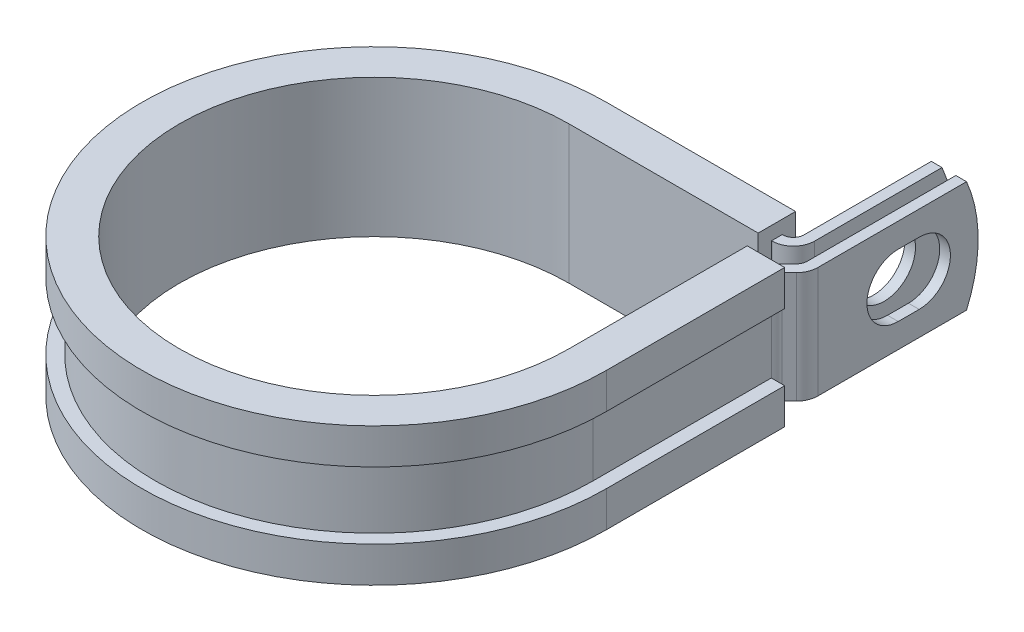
ISO-10303-21;
HEADER;
FILE_DESCRIPTION(('STEP AP214'),'2;1');
FILE_NAME('part.step','',(''),(''),'','','');
FILE_SCHEMA(('AUTOMOTIVE_DESIGN { 1 0 10303 214 1 1 1 1 }'));
ENDSEC;
DATA;
#1=APPLICATION_CONTEXT('core data for automotive mechanical design processes');
#2=APPLICATION_PROTOCOL_DEFINITION('international standard','automotive_design',2000,#1);
#3=PRODUCT_CONTEXT('',#1,'mechanical');
#4=PRODUCT('Part','Part','',(#3));
#5=PRODUCT_RELATED_PRODUCT_CATEGORY('part','',(#4));
#6=PRODUCT_DEFINITION_FORMATION('','',#4);
#7=PRODUCT_DEFINITION_CONTEXT('part definition',#1,'design');
#8=PRODUCT_DEFINITION('design','',#6,#7);
#9=PRODUCT_DEFINITION_SHAPE('','',#8);
#10=(LENGTH_UNIT() NAMED_UNIT(*) SI_UNIT(.MILLI.,.METRE.));
#11=(NAMED_UNIT(*) PLANE_ANGLE_UNIT() SI_UNIT($,.RADIAN.));
#12=(NAMED_UNIT(*) SI_UNIT($,.STERADIAN.) SOLID_ANGLE_UNIT());
#13=UNCERTAINTY_MEASURE_WITH_UNIT(LENGTH_MEASURE(1.E-05),#10,'distance_accuracy_value','');
#14=(GEOMETRIC_REPRESENTATION_CONTEXT(3) GLOBAL_UNCERTAINTY_ASSIGNED_CONTEXT((#13)) GLOBAL_UNIT_ASSIGNED_CONTEXT((#10,
#11,#12)) REPRESENTATION_CONTEXT('',''));
#15=CARTESIAN_POINT('',(0.,0.,0.));
#16=DIRECTION('',(0.,0.,1.));
#17=DIRECTION('',(1.,0.,0.));
#18=AXIS2_PLACEMENT_3D('',#15,#16,#17);
#19=CARTESIAN_POINT('',(24.4272698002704,-6.35,-23.749));
#20=DIRECTION('',(0.,1.,0.));
#21=DIRECTION('',(1.,0.,0.));
#22=AXIS2_PLACEMENT_3D('',#19,#20,#21);
#23=PLANE('',#22);
#24=DIRECTION('',(0.,0.,-1.));
#25=VECTOR('',#24,1.);
#26=CARTESIAN_POINT('',(21.5824698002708,-6.35,-23.749));
#27=LINE('',#26,#25);
#28=CARTESIAN_POINT('',(21.5824698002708,-6.35,-23.749));
#29=VERTEX_POINT('',#28);
#30=CARTESIAN_POINT('',(21.5824698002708,-6.35,-24.9682));
#31=VERTEX_POINT('',#30);
#32=EDGE_CURVE('E523',#29,#31,#27,.T.);
#33=ORIENTED_EDGE('',*,*,#32,.T.);
#34=DIRECTION('',(1.,0.,0.));
#35=VECTOR('',#34,1.);
#36=CARTESIAN_POINT('',(0.,-6.35,-24.9682));
#37=LINE('',#36,#35);
#38=CARTESIAN_POINT('',(21.6332698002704,-6.35,-24.9682));
#39=VERTEX_POINT('',#38);
#40=EDGE_CURVE('E410',#39,#31,#37,.F.);
#41=ORIENTED_EDGE('',*,*,#40,.F.);
#42=CARTESIAN_POINT('',(21.6332698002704,-6.35,-26.1874));
#43=DIRECTION('',(0.,1.,0.));
#44=DIRECTION('',(1.,0.,0.));
#45=AXIS2_PLACEMENT_3D('',#42,#43,#44);
#46=CIRCLE('',#45,1.2192);
#47=CARTESIAN_POINT('',(22.8524698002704,-6.35,-26.1874));
#48=VERTEX_POINT('',#47);
#49=EDGE_CURVE('E408',#48,#39,#46,.F.);
#50=ORIENTED_EDGE('',*,*,#49,.F.);
#51=DIRECTION('',(0.,0.,1.));
#52=VECTOR('',#51,1.);
#53=CARTESIAN_POINT('',(22.8524698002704,-6.35,-42.037));
#54=LINE('',#53,#52);
#55=CARTESIAN_POINT('',(22.8524698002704,-6.35,-40.7116778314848));
#56=VERTEX_POINT('',#55);
#57=EDGE_CURVE('E406',#56,#48,#54,.T.);
#58=ORIENTED_EDGE('',*,*,#57,.F.);
#59=DIRECTION('',(-1.,0.,0.));
#60=VECTOR('',#59,1.);
#61=CARTESIAN_POINT('',(26.8656698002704,-6.35,-40.7116778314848));
#62=LINE('',#61,#60);
#63=CARTESIAN_POINT('',(24.0716698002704,-6.35,-40.7116778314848));
#64=VERTEX_POINT('',#63);
#65=EDGE_CURVE('E12',#64,#56,#62,.T.);
#66=ORIENTED_EDGE('',*,*,#65,.F.);
#67=DIRECTION('',(0.,0.,1.));
#68=VECTOR('',#67,1.);
#69=CARTESIAN_POINT('',(24.0716698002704,-6.35,-42.037));
#70=LINE('',#69,#68);
#71=CARTESIAN_POINT('',(24.0716698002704,-6.35,-26.1874));
#72=VERTEX_POINT('',#71);
#73=EDGE_CURVE('E404',#64,#72,#70,.T.);
#74=ORIENTED_EDGE('',*,*,#73,.T.);
#75=CARTESIAN_POINT('',(21.6332698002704,-6.35,-26.1874));
#76=DIRECTION('',(0.,-1.,0.));
#77=DIRECTION('',(0.,0.,1.));
#78=AXIS2_PLACEMENT_3D('',#75,#76,#77);
#79=CIRCLE('',#78,2.4384);
#80=CARTESIAN_POINT('',(21.6332698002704,-6.35,-23.749));
#81=VERTEX_POINT('',#80);
#82=EDGE_CURVE('E401',#72,#81,#79,.T.);
#83=ORIENTED_EDGE('',*,*,#82,.T.);
#84=DIRECTION('',(-1.,0.,0.));
#85=VECTOR('',#84,1.);
#86=CARTESIAN_POINT('',(0.,-6.35,-23.749));
#87=LINE('',#86,#85);
#88=EDGE_CURVE('E398',#81,#29,#87,.T.);
#89=ORIENTED_EDGE('',*,*,#88,.T.);
#90=EDGE_LOOP('',(#33,#41,#50,#58,#66,#74,#83,#89));
#91=FACE_BOUND('',#90,.T.);
#92=ADVANCED_FACE('F54',(#91),#23,.F.);
#93=CARTESIAN_POINT('',(24.4272698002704,6.35,-23.749));
#94=DIRECTION('',(0.,1.,0.));
#95=DIRECTION('',(1.,0.,0.));
#96=AXIS2_PLACEMENT_3D('',#93,#94,#95);
#97=PLANE('',#96);
#98=DIRECTION('',(1.,0.,0.));
#99=VECTOR('',#98,1.);
#100=CARTESIAN_POINT('',(0.,6.35,-24.9682));
#101=LINE('',#100,#99);
#102=CARTESIAN_POINT('',(21.6332698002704,6.35,-24.9682));
#103=VERTEX_POINT('',#102);
#104=CARTESIAN_POINT('',(21.5824698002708,6.35,-24.9682));
#105=VERTEX_POINT('',#104);
#106=EDGE_CURVE('E368',#103,#105,#101,.F.);
#107=ORIENTED_EDGE('',*,*,#106,.T.);
#108=DIRECTION('',(0.,0.,1.));
#109=VECTOR('',#108,1.);
#110=CARTESIAN_POINT('',(21.5824698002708,6.35,-24.9682));
#111=LINE('',#110,#109);
#112=CARTESIAN_POINT('',(21.5824698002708,6.35,-23.749));
#113=VERTEX_POINT('',#112);
#114=EDGE_CURVE('E517',#105,#113,#111,.T.);
#115=ORIENTED_EDGE('',*,*,#114,.T.);
#116=DIRECTION('',(-1.,0.,0.));
#117=VECTOR('',#116,1.);
#118=CARTESIAN_POINT('',(0.,6.35,-23.749));
#119=LINE('',#118,#117);
#120=CARTESIAN_POINT('',(21.6332698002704,6.35,-23.749));
#121=VERTEX_POINT('',#120);
#122=EDGE_CURVE('E625',#121,#113,#119,.T.);
#123=ORIENTED_EDGE('',*,*,#122,.F.);
#124=CARTESIAN_POINT('',(21.6332698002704,6.35,-26.1874));
#125=DIRECTION('',(0.,-1.,0.));
#126=DIRECTION('',(0.,0.,1.));
#127=AXIS2_PLACEMENT_3D('',#124,#125,#126);
#128=CIRCLE('',#127,2.4384);
#129=CARTESIAN_POINT('',(24.0716698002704,6.35,-26.1874));
#130=VERTEX_POINT('',#129);
#131=EDGE_CURVE('E370',#130,#121,#128,.T.);
#132=ORIENTED_EDGE('',*,*,#131,.F.);
#133=DIRECTION('',(0.,0.,1.));
#134=VECTOR('',#133,1.);
#135=CARTESIAN_POINT('',(24.0716698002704,6.35,-42.037));
#136=LINE('',#135,#134);
#137=CARTESIAN_POINT('',(24.0716698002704,6.35,-40.7116778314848));
#138=VERTEX_POINT('',#137);
#139=EDGE_CURVE('E361',#138,#130,#136,.T.);
#140=ORIENTED_EDGE('',*,*,#139,.F.);
#141=DIRECTION('',(-1.,0.,0.));
#142=VECTOR('',#141,1.);
#143=CARTESIAN_POINT('',(26.8656698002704,6.35,-40.7116778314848));
#144=LINE('',#143,#142);
#145=CARTESIAN_POINT('',(22.8524698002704,6.35,-40.7116778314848));
#146=VERTEX_POINT('',#145);
#147=EDGE_CURVE('E62',#138,#146,#144,.T.);
#148=ORIENTED_EDGE('',*,*,#147,.T.);
#149=DIRECTION('',(0.,0.,1.));
#150=VECTOR('',#149,1.);
#151=CARTESIAN_POINT('',(22.8524698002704,6.35,-42.037));
#152=LINE('',#151,#150);
#153=CARTESIAN_POINT('',(22.8524698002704,6.35,-26.1874));
#154=VERTEX_POINT('',#153);
#155=EDGE_CURVE('E358',#146,#154,#152,.T.);
#156=ORIENTED_EDGE('',*,*,#155,.T.);
#157=CARTESIAN_POINT('',(21.6332698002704,6.35,-26.1874));
#158=DIRECTION('',(0.,1.,0.));
#159=DIRECTION('',(1.,0.,0.));
#160=AXIS2_PLACEMENT_3D('',#157,#158,#159);
#161=CIRCLE('',#160,1.2192);
#162=EDGE_CURVE('E366',#154,#103,#161,.F.);
#163=ORIENTED_EDGE('',*,*,#162,.T.);
#164=EDGE_LOOP('',(#107,#115,#123,#132,#140,#148,#156,#163));
#165=FACE_BOUND('',#164,.T.);
#166=ADVANCED_FACE('F357',(#165),#97,.T.);
#167=CARTESIAN_POINT('',(0.,6.35,-23.749));
#168=DIRECTION('',(0.,0.,1.));
#169=DIRECTION('',(1.,0.,0.));
#170=AXIS2_PLACEMENT_3D('',#167,#168,#169);
#171=PLANE('',#170);
#172=ORIENTED_EDGE('',*,*,#122,.T.);
#173=DIRECTION('',(0.,-1.,0.));
#174=VECTOR('',#173,1.);
#175=CARTESIAN_POINT('',(21.5824698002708,6.35,-23.749));
#176=LINE('',#175,#174);
#177=EDGE_CURVE('E520',#113,#29,#176,.T.);
#178=ORIENTED_EDGE('',*,*,#177,.T.);
#179=ORIENTED_EDGE('',*,*,#88,.F.);
#180=DIRECTION('',(0.,-1.,0.));
#181=VECTOR('',#180,1.);
#182=CARTESIAN_POINT('',(21.6332698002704,6.35,-23.749));
#183=LINE('',#182,#181);
#184=EDGE_CURVE('E344',#121,#81,#183,.T.);
#185=ORIENTED_EDGE('',*,*,#184,.F.);
#186=EDGE_LOOP('',(#172,#178,#179,#185));
#187=FACE_BOUND('',#186,.T.);
#188=ADVANCED_FACE('F635',(#187),#171,.T.);
#189=CARTESIAN_POINT('',(26.8656698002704,6.35,-23.749));
#190=DIRECTION('',(-1.,0.,0.));
#191=DIRECTION('',(0.,0.,1.));
#192=AXIS2_PLACEMENT_3D('',#189,#190,#191);
#193=PLANE('',#192);
#194=CARTESIAN_POINT('',(26.8656698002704,0.,-35.3059999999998));
#195=DIRECTION('',(1.,0.,0.));
#196=DIRECTION('',(0.,0.,-1.));
#197=AXIS2_PLACEMENT_3D('',#194,#195,#196);
#198=CIRCLE('',#197,3.5687);
#199=CARTESIAN_POINT('',(26.8656698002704,-3.5687,-35.3060000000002));
#200=VERTEX_POINT('',#199);
#201=CARTESIAN_POINT('',(26.8656698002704,3.5687,-35.3060000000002));
#202=VERTEX_POINT('',#201);
#203=EDGE_CURVE('E580',#200,#202,#198,.T.);
#204=ORIENTED_EDGE('',*,*,#203,.F.);
#205=DIRECTION('',(0.,0.,-1.));
#206=VECTOR('',#205,1.);
#207=CARTESIAN_POINT('',(26.8656698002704,-3.5687,-32.9183999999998));
#208=LINE('',#207,#206);
#209=CARTESIAN_POINT('',(26.8656698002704,-3.5687,-32.9183999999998));
#210=VERTEX_POINT('',#209);
#211=EDGE_CURVE('E583',#210,#200,#208,.T.);
#212=ORIENTED_EDGE('',*,*,#211,.F.);
#213=CARTESIAN_POINT('',(26.8656698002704,0.,-32.9183999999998));
#214=DIRECTION('',(1.,0.,0.));
#215=DIRECTION('',(0.,0.,-1.));
#216=AXIS2_PLACEMENT_3D('',#213,#214,#215);
#217=CIRCLE('',#216,3.5687);
#218=CARTESIAN_POINT('',(26.8656698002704,3.5687,-32.9183999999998));
#219=VERTEX_POINT('',#218);
#220=EDGE_CURVE('E576',#219,#210,#217,.T.);
#221=ORIENTED_EDGE('',*,*,#220,.F.);
#222=DIRECTION('',(0.,0.,1.));
#223=VECTOR('',#222,1.);
#224=CARTESIAN_POINT('',(26.8656698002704,3.5687,-32.9183999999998));
#225=LINE('',#224,#223);
#226=EDGE_CURVE('E577',#202,#219,#225,.T.);
#227=ORIENTED_EDGE('',*,*,#226,.F.);
#228=EDGE_LOOP('',(#204,#212,#221,#227));
#229=FACE_BOUND('',#228,.T.);
#230=DIRECTION('',(0.,0.,-1.));
#231=VECTOR('',#230,1.);
#232=CARTESIAN_POINT('',(26.8656698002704,-6.35,-23.749));
#233=LINE('',#232,#231);
#234=CARTESIAN_POINT('',(26.8656698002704,-6.35,-23.749));
#235=VERTEX_POINT('',#234);
#236=CARTESIAN_POINT('',(26.8656698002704,-6.35,-40.7116778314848));
#237=VERTEX_POINT('',#236);
#238=EDGE_CURVE('E382',#235,#237,#233,.T.);
#239=ORIENTED_EDGE('',*,*,#238,.T.);
#240=CARTESIAN_POINT('',(26.8656698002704,0.,-26.162));
#241=DIRECTION('',(-1.,0.,0.));
#242=DIRECTION('',(0.,0.,1.));
#243=AXIS2_PLACEMENT_3D('',#240,#241,#242);
#244=CIRCLE('',#243,15.875);
#245=CARTESIAN_POINT('',(26.8656698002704,6.35,-40.7116778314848));
#246=VERTEX_POINT('',#245);
#247=EDGE_CURVE('E568',#246,#237,#244,.T.);
#248=ORIENTED_EDGE('',*,*,#247,.F.);
#249=DIRECTION('',(0.,0.,-1.));
#250=VECTOR('',#249,1.);
#251=CARTESIAN_POINT('',(26.8656698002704,6.35,-23.749));
#252=LINE('',#251,#250);
#253=CARTESIAN_POINT('',(26.8656698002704,6.35,-23.749));
#254=VERTEX_POINT('',#253);
#255=EDGE_CURVE('E419',#254,#246,#252,.T.);
#256=ORIENTED_EDGE('',*,*,#255,.F.);
#257=DIRECTION('',(0.,-1.,0.));
#258=VECTOR('',#257,1.);
#259=CARTESIAN_POINT('',(26.8656698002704,6.35,-23.749));
#260=LINE('',#259,#258);
#261=EDGE_CURVE('E381',#254,#235,#260,.T.);
#262=ORIENTED_EDGE('',*,*,#261,.T.);
#263=EDGE_LOOP('',(#239,#248,#256,#262));
#264=FACE_BOUND('',#263,.T.);
#265=ADVANCED_FACE('F56',(#229,#264),#193,.F.);
#266=CARTESIAN_POINT('',(25.6464698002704,6.35,-23.749));
#267=DIRECTION('',(-1.,0.,0.));
#268=DIRECTION('',(0.,0.,1.));
#269=AXIS2_PLACEMENT_3D('',#266,#267,#268);
#270=PLANE('',#269);
#271=DIRECTION('',(0.,0.,-1.));
#272=VECTOR('',#271,1.);
#273=CARTESIAN_POINT('',(25.6464698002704,-3.5687,-32.9183999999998));
#274=LINE('',#273,#272);
#275=CARTESIAN_POINT('',(25.6464698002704,-3.5687,-32.9183999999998));
#276=VERTEX_POINT('',#275);
#277=CARTESIAN_POINT('',(25.6464698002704,-3.5687,-35.3060000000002));
#278=VERTEX_POINT('',#277);
#279=EDGE_CURVE('E579',#276,#278,#274,.T.);
#280=ORIENTED_EDGE('',*,*,#279,.T.);
#281=CARTESIAN_POINT('',(25.6464698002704,0.,-35.3059999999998));
#282=DIRECTION('',(-1.,0.,0.));
#283=DIRECTION('',(0.,0.,1.));
#284=AXIS2_PLACEMENT_3D('',#281,#282,#283);
#285=CIRCLE('',#284,3.5687);
#286=CARTESIAN_POINT('',(25.6464698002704,3.5687,-35.3060000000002));
#287=VERTEX_POINT('',#286);
#288=EDGE_CURVE('E600',#278,#287,#285,.F.);
#289=ORIENTED_EDGE('',*,*,#288,.T.);
#290=DIRECTION('',(0.,0.,1.));
#291=VECTOR('',#290,1.);
#292=CARTESIAN_POINT('',(25.6464698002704,3.5687,-32.9183999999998));
#293=LINE('',#292,#291);
#294=CARTESIAN_POINT('',(25.6464698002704,3.5687,-32.9183999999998));
#295=VERTEX_POINT('',#294);
#296=EDGE_CURVE('E596',#287,#295,#293,.T.);
#297=ORIENTED_EDGE('',*,*,#296,.T.);
#298=CARTESIAN_POINT('',(25.6464698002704,0.,-32.9183999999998));
#299=DIRECTION('',(-1.,0.,0.));
#300=DIRECTION('',(0.,0.,1.));
#301=AXIS2_PLACEMENT_3D('',#298,#299,#300);
#302=CIRCLE('',#301,3.5687);
#303=EDGE_CURVE('E591',#295,#276,#302,.F.);
#304=ORIENTED_EDGE('',*,*,#303,.T.);
#305=EDGE_LOOP('',(#280,#289,#297,#304));
#306=FACE_BOUND('',#305,.T.);
#307=CARTESIAN_POINT('',(25.6464698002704,0.,-26.162));
#308=DIRECTION('',(-1.,0.,0.));
#309=DIRECTION('',(0.,0.,1.));
#310=AXIS2_PLACEMENT_3D('',#307,#308,#309);
#311=CIRCLE('',#310,15.875);
#312=CARTESIAN_POINT('',(25.6464698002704,6.35,-40.7116778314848));
#313=VERTEX_POINT('',#312);
#314=CARTESIAN_POINT('',(25.6464698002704,-6.35,-40.7116778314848));
#315=VERTEX_POINT('',#314);
#316=EDGE_CURVE('E76',#313,#315,#311,.T.);
#317=ORIENTED_EDGE('',*,*,#316,.T.);
#318=DIRECTION('',(0.,0.,-1.));
#319=VECTOR('',#318,1.);
#320=CARTESIAN_POINT('',(25.6464698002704,-6.35,-23.749));
#321=LINE('',#320,#319);
#322=CARTESIAN_POINT('',(25.6464698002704,-6.35,-23.749));
#323=VERTEX_POINT('',#322);
#324=EDGE_CURVE('E385',#323,#315,#321,.T.);
#325=ORIENTED_EDGE('',*,*,#324,.F.);
#326=DIRECTION('',(0.,-1.,0.));
#327=VECTOR('',#326,1.);
#328=CARTESIAN_POINT('',(25.6464698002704,6.35,-23.749));
#329=LINE('',#328,#327);
#330=CARTESIAN_POINT('',(25.6464698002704,6.35,-23.749));
#331=VERTEX_POINT('',#330);
#332=EDGE_CURVE('E352',#331,#323,#329,.T.);
#333=ORIENTED_EDGE('',*,*,#332,.F.);
#334=DIRECTION('',(0.,0.,-1.));
#335=VECTOR('',#334,1.);
#336=CARTESIAN_POINT('',(25.6464698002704,6.35,-23.749));
#337=LINE('',#336,#335);
#338=EDGE_CURVE('E615',#331,#313,#337,.T.);
#339=ORIENTED_EDGE('',*,*,#338,.T.);
#340=EDGE_LOOP('',(#317,#325,#333,#339));
#341=FACE_BOUND('',#340,.T.);
#342=ADVANCED_FACE('F689',(#306,#341),#270,.T.);
#343=CARTESIAN_POINT('',(24.0716698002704,6.35,-42.037));
#344=DIRECTION('',(1.,0.,0.));
#345=DIRECTION('',(0.,0.,-1.));
#346=AXIS2_PLACEMENT_3D('',#343,#344,#345);
#347=PLANE('',#346);
#348=CARTESIAN_POINT('',(24.0716698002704,0.,-34.1122));
#349=DIRECTION('',(1.,0.,0.));
#350=DIRECTION('',(0.,0.,-1.));
#351=AXIS2_PLACEMENT_3D('',#348,#349,#350);
#352=CIRCLE('',#351,3.5687);
#353=CARTESIAN_POINT('',(24.0716698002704,0.,-37.6809));
#354=VERTEX_POINT('',#353);
#355=EDGE_CURVE('E386',#354,#354,#352,.F.);
#356=ORIENTED_EDGE('',*,*,#355,.T.);
#357=EDGE_LOOP('',(#356));
#358=FACE_BOUND('',#357,.T.);
#359=ORIENTED_EDGE('',*,*,#73,.F.);
#360=CARTESIAN_POINT('',(24.0716698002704,0.,-26.162));
#361=DIRECTION('',(1.,0.,0.));
#362=DIRECTION('',(0.,0.,-1.));
#363=AXIS2_PLACEMENT_3D('',#360,#361,#362);
#364=CIRCLE('',#363,15.875);
#365=EDGE_CURVE('E573',#64,#138,#364,.T.);
#366=ORIENTED_EDGE('',*,*,#365,.T.);
#367=ORIENTED_EDGE('',*,*,#139,.T.);
#368=DIRECTION('',(0.,-1.,0.));
#369=VECTOR('',#368,1.);
#370=CARTESIAN_POINT('',(24.0716698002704,6.35,-26.1874));
#371=LINE('',#370,#369);
#372=EDGE_CURVE('E341',#130,#72,#371,.T.);
#373=ORIENTED_EDGE('',*,*,#372,.T.);
#374=EDGE_LOOP('',(#359,#366,#367,#373));
#375=FACE_BOUND('',#374,.T.);
#376=ADVANCED_FACE('F641',(#358,#375),#347,.T.);
#377=CARTESIAN_POINT('',(22.8524698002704,6.35,-42.037));
#378=DIRECTION('',(1.,0.,0.));
#379=DIRECTION('',(0.,0.,-1.));
#380=AXIS2_PLACEMENT_3D('',#377,#378,#379);
#381=PLANE('',#380);
#382=CARTESIAN_POINT('',(22.8524698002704,0.,-34.1122));
#383=DIRECTION('',(-1.,0.,0.));
#384=DIRECTION('',(0.,0.,1.));
#385=AXIS2_PLACEMENT_3D('',#382,#383,#384);
#386=CIRCLE('',#385,3.5687);
#387=CARTESIAN_POINT('',(22.8524698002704,0.,-30.5435));
#388=VERTEX_POINT('',#387);
#389=EDGE_CURVE('E608',#388,#388,#386,.T.);
#390=ORIENTED_EDGE('',*,*,#389,.F.);
#391=EDGE_LOOP('',(#390));
#392=FACE_BOUND('',#391,.T.);
#393=CARTESIAN_POINT('',(22.8524698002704,0.,-26.162));
#394=DIRECTION('',(-1.,0.,0.));
#395=DIRECTION('',(0.,0.,1.));
#396=AXIS2_PLACEMENT_3D('',#393,#394,#395);
#397=CIRCLE('',#396,15.875);
#398=EDGE_CURVE('E68',#146,#56,#397,.T.);
#399=ORIENTED_EDGE('',*,*,#398,.T.);
#400=ORIENTED_EDGE('',*,*,#57,.T.);
#401=DIRECTION('',(0.,-1.,0.));
#402=VECTOR('',#401,1.);
#403=CARTESIAN_POINT('',(22.8524698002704,6.35,-26.1874));
#404=LINE('',#403,#402);
#405=EDGE_CURVE('E338',#154,#48,#404,.T.);
#406=ORIENTED_EDGE('',*,*,#405,.F.);
#407=ORIENTED_EDGE('',*,*,#155,.F.);
#408=EDGE_LOOP('',(#399,#400,#406,#407));
#409=FACE_BOUND('',#408,.T.);
#410=ADVANCED_FACE('F364',(#392,#409),#381,.F.);
#411=CARTESIAN_POINT('',(26.1874,-6.35,-20.3365026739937));
#412=DIRECTION('',(0.,1.,0.));
#413=DIRECTION('',(1.,0.,0.));
#414=AXIS2_PLACEMENT_3D('',#411,#412,#413);
#415=CIRCLE('',#414,1.2192);
#416=CARTESIAN_POINT('',(24.9682,-6.35,-20.3365026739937));
#417=VERTEX_POINT('',#416);
#418=CARTESIAN_POINT('',(25.3252954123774,-6.35,-21.1986072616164));
#419=VERTEX_POINT('',#418);
#420=EDGE_CURVE('E413',#417,#419,#415,.F.);
#421=ORIENTED_EDGE('',*,*,#420,.F.);
#422=DIRECTION('',(1.,0.,0.));
#423=VECTOR('',#422,1.);
#424=CARTESIAN_POINT('',(23.749,-6.35,-20.3365026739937));
#425=LINE('',#424,#423);
#426=CARTESIAN_POINT('',(23.749,-6.35,-20.3365026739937));
#427=VERTEX_POINT('',#426);
#428=EDGE_CURVE('E451',#427,#417,#425,.T.);
#429=ORIENTED_EDGE('',*,*,#428,.F.);
#430=CARTESIAN_POINT('',(26.1874,-6.35,-20.3365026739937));
#431=DIRECTION('',(0.,-1.,0.));
#432=DIRECTION('',(0.,0.,1.));
#433=AXIS2_PLACEMENT_3D('',#430,#431,#432);
#434=CIRCLE('',#433,2.4384);
#435=CARTESIAN_POINT('',(24.4631908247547,-6.35,-22.060711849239));
#436=VERTEX_POINT('',#435);
#437=EDGE_CURVE('E395',#427,#436,#434,.T.);
#438=ORIENTED_EDGE('',*,*,#437,.T.);
#439=DIRECTION('',(0.707106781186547,0.,-0.707106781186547));
#440=VECTOR('',#439,1.);
#441=CARTESIAN_POINT('',(24.4631908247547,-6.35,-22.060711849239));
#442=LINE('',#441,#440);
#443=CARTESIAN_POINT('',(25.2893743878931,-6.35,-22.8868954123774));
#444=VERTEX_POINT('',#443);
#445=EDGE_CURVE('E392',#436,#444,#442,.T.);
#446=ORIENTED_EDGE('',*,*,#445,.T.);
#447=CARTESIAN_POINT('',(24.4272698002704,-6.35,-23.749));
#448=DIRECTION('',(0.,1.,0.));
#449=DIRECTION('',(0.,0.,1.));
#450=AXIS2_PLACEMENT_3D('',#447,#448,#449);
#451=CIRCLE('',#450,1.2192);
#452=EDGE_CURVE('E389',#444,#323,#451,.T.);
#453=ORIENTED_EDGE('',*,*,#452,.T.);
#454=ORIENTED_EDGE('',*,*,#324,.T.);
#455=DIRECTION('',(-1.,0.,0.));
#456=VECTOR('',#455,1.);
#457=CARTESIAN_POINT('',(26.8656698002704,-6.35,-40.7116778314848));
#458=LINE('',#457,#456);
#459=EDGE_CURVE('E566',#237,#315,#458,.T.);
#460=ORIENTED_EDGE('',*,*,#459,.F.);
#461=ORIENTED_EDGE('',*,*,#238,.F.);
#462=CARTESIAN_POINT('',(24.4272698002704,-6.35,-23.749));
#463=DIRECTION('',(0.,1.,0.));
#464=DIRECTION('',(1.,0.,0.));
#465=AXIS2_PLACEMENT_3D('',#462,#463,#464);
#466=CIRCLE('',#465,2.4384);
#467=CARTESIAN_POINT('',(26.1514789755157,-6.35,-22.0247908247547));
#468=VERTEX_POINT('',#467);
#469=EDGE_CURVE('E417',#468,#235,#466,.T.);
#470=ORIENTED_EDGE('',*,*,#469,.F.);
#471=DIRECTION('',(0.707106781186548,0.,-0.707106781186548));
#472=VECTOR('',#471,1.);
#473=CARTESIAN_POINT('',(25.3252954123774,-6.35,-21.1986072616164));
#474=LINE('',#473,#472);
#475=EDGE_CURVE('E415',#419,#468,#474,.T.);
#476=ORIENTED_EDGE('',*,*,#475,.F.);
#477=EDGE_LOOP('',(#421,#429,#438,#446,#453,#454,#460,#461,#470,#476));
#478=FACE_BOUND('',#477,.T.);
#479=ADVANCED_FACE('F675',(#478),#23,.F.);
#480=DIRECTION('',(-1.,0.,0.));
#481=VECTOR('',#480,1.);
#482=CARTESIAN_POINT('',(24.9682,6.35,-20.3365026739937));
#483=LINE('',#482,#481);
#484=CARTESIAN_POINT('',(24.9682,6.35,-20.3365026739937));
#485=VERTEX_POINT('',#484);
#486=CARTESIAN_POINT('',(23.749,6.35,-20.3365026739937));
#487=VERTEX_POINT('',#486);
#488=EDGE_CURVE('E440',#485,#487,#483,.T.);
#489=ORIENTED_EDGE('',*,*,#488,.F.);
#490=CARTESIAN_POINT('',(26.1874,6.35,-20.3365026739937));
#491=DIRECTION('',(0.,1.,0.));
#492=DIRECTION('',(1.,0.,0.));
#493=AXIS2_PLACEMENT_3D('',#490,#491,#492);
#494=CIRCLE('',#493,1.2192);
#495=CARTESIAN_POINT('',(25.3252954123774,6.35,-21.1986072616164));
#496=VERTEX_POINT('',#495);
#497=EDGE_CURVE('E375',#485,#496,#494,.F.);
#498=ORIENTED_EDGE('',*,*,#497,.T.);
#499=DIRECTION('',(0.707106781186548,0.,-0.707106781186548));
#500=VECTOR('',#499,1.);
#501=CARTESIAN_POINT('',(25.3252954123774,6.35,-21.1986072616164));
#502=LINE('',#501,#500);
#503=CARTESIAN_POINT('',(26.1514789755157,6.35,-22.0247908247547));
#504=VERTEX_POINT('',#503);
#505=EDGE_CURVE('E377',#496,#504,#502,.T.);
#506=ORIENTED_EDGE('',*,*,#505,.T.);
#507=CARTESIAN_POINT('',(24.4272698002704,6.35,-23.749));
#508=DIRECTION('',(0.,1.,0.));
#509=DIRECTION('',(1.,0.,0.));
#510=AXIS2_PLACEMENT_3D('',#507,#508,#509);
#511=CIRCLE('',#510,2.4384);
#512=EDGE_CURVE('E379',#504,#254,#511,.T.);
#513=ORIENTED_EDGE('',*,*,#512,.T.);
#514=ORIENTED_EDGE('',*,*,#255,.T.);
#515=DIRECTION('',(-1.,0.,0.));
#516=VECTOR('',#515,1.);
#517=CARTESIAN_POINT('',(26.8656698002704,6.35,-40.7116778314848));
#518=LINE('',#517,#516);
#519=EDGE_CURVE('E570',#246,#313,#518,.T.);
#520=ORIENTED_EDGE('',*,*,#519,.T.);
#521=ORIENTED_EDGE('',*,*,#338,.F.);
#522=CARTESIAN_POINT('',(24.4272698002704,6.35,-23.749));
#523=DIRECTION('',(0.,1.,0.));
#524=DIRECTION('',(0.,0.,1.));
#525=AXIS2_PLACEMENT_3D('',#522,#523,#524);
#526=CIRCLE('',#525,1.2192);
#527=CARTESIAN_POINT('',(25.2893743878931,6.35,-22.8868954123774));
#528=VERTEX_POINT('',#527);
#529=EDGE_CURVE('E618',#528,#331,#526,.T.);
#530=ORIENTED_EDGE('',*,*,#529,.F.);
#531=DIRECTION('',(0.707106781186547,0.,-0.707106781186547));
#532=VECTOR('',#531,1.);
#533=CARTESIAN_POINT('',(24.4631908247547,6.35,-22.060711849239));
#534=LINE('',#533,#532);
#535=CARTESIAN_POINT('',(24.4631908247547,6.35,-22.060711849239));
#536=VERTEX_POINT('',#535);
#537=EDGE_CURVE('E621',#536,#528,#534,.T.);
#538=ORIENTED_EDGE('',*,*,#537,.F.);
#539=CARTESIAN_POINT('',(26.1874,6.35,-20.3365026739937));
#540=DIRECTION('',(0.,-1.,0.));
#541=DIRECTION('',(0.,0.,1.));
#542=AXIS2_PLACEMENT_3D('',#539,#540,#541);
#543=CIRCLE('',#542,2.4384);
#544=EDGE_CURVE('E450',#487,#536,#543,.T.);
#545=ORIENTED_EDGE('',*,*,#544,.F.);
#546=EDGE_LOOP('',(#489,#498,#506,#513,#514,#520,#521,#530,#538,#545));
#547=FACE_BOUND('',#546,.T.);
#548=ADVANCED_FACE('F447',(#547),#97,.T.);
#549=CARTESIAN_POINT('',(24.4272698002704,6.35,-23.749));
#550=DIRECTION('',(0.,-1.,0.));
#551=DIRECTION('',(0.,0.,-1.));
#552=AXIS2_PLACEMENT_3D('',#549,#550,#551);
#553=CYLINDRICAL_SURFACE('',#552,1.2192);
#554=ORIENTED_EDGE('',*,*,#452,.F.);
#555=DIRECTION('',(0.,-1.,0.));
#556=VECTOR('',#555,1.);
#557=CARTESIAN_POINT('',(25.2893743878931,6.35,-22.8868954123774));
#558=LINE('',#557,#556);
#559=EDGE_CURVE('E350',#528,#444,#558,.T.);
#560=ORIENTED_EDGE('',*,*,#559,.F.);
#561=ORIENTED_EDGE('',*,*,#529,.T.);
#562=ORIENTED_EDGE('',*,*,#332,.T.);
#563=EDGE_LOOP('',(#554,#560,#561,#562));
#564=FACE_BOUND('',#563,.T.);
#565=ADVANCED_FACE('F685',(#564),#553,.F.);
#566=CARTESIAN_POINT('',(24.4631908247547,6.35,-22.060711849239));
#567=DIRECTION('',(-0.707106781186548,0.,-0.707106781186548));
#568=DIRECTION('',(-0.707106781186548,0.,0.707106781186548));
#569=AXIS2_PLACEMENT_3D('',#566,#567,#568);
#570=PLANE('',#569);
#571=ORIENTED_EDGE('',*,*,#445,.F.);
#572=DIRECTION('',(0.,-1.,0.));
#573=VECTOR('',#572,1.);
#574=CARTESIAN_POINT('',(24.4631908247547,6.35,-22.060711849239));
#575=LINE('',#574,#573);
#576=EDGE_CURVE('E348',#536,#436,#575,.T.);
#577=ORIENTED_EDGE('',*,*,#576,.F.);
#578=ORIENTED_EDGE('',*,*,#537,.T.);
#579=ORIENTED_EDGE('',*,*,#559,.T.);
#580=EDGE_LOOP('',(#571,#577,#578,#579));
#581=FACE_BOUND('',#580,.T.);
#582=ADVANCED_FACE('F680',(#581),#570,.T.);
#583=CARTESIAN_POINT('',(26.1874,6.35,-20.3365026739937));
#584=DIRECTION('',(0.,-1.,0.));
#585=DIRECTION('',(0.,0.,-1.));
#586=AXIS2_PLACEMENT_3D('',#583,#584,#585);
#587=CYLINDRICAL_SURFACE('',#586,2.4384);
#588=ORIENTED_EDGE('',*,*,#437,.F.);
#589=DIRECTION('',(0.,-1.,0.));
#590=VECTOR('',#589,1.);
#591=CARTESIAN_POINT('',(23.749,6.35,-20.3365026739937));
#592=LINE('',#591,#590);
#593=EDGE_CURVE('E346',#487,#427,#592,.T.);
#594=ORIENTED_EDGE('',*,*,#593,.F.);
#595=ORIENTED_EDGE('',*,*,#544,.T.);
#596=ORIENTED_EDGE('',*,*,#576,.T.);
#597=EDGE_LOOP('',(#588,#594,#595,#596));
#598=FACE_BOUND('',#597,.T.);
#599=ADVANCED_FACE('F677',(#598),#587,.T.);
#600=CARTESIAN_POINT('',(21.6332698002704,6.35,-26.1874));
#601=DIRECTION('',(0.,-1.,0.));
#602=DIRECTION('',(0.,0.,-1.));
#603=AXIS2_PLACEMENT_3D('',#600,#601,#602);
#604=CYLINDRICAL_SURFACE('',#603,2.4384);
#605=ORIENTED_EDGE('',*,*,#82,.F.);
#606=ORIENTED_EDGE('',*,*,#372,.F.);
#607=ORIENTED_EDGE('',*,*,#131,.T.);
#608=ORIENTED_EDGE('',*,*,#184,.T.);
#609=EDGE_LOOP('',(#605,#606,#607,#608));
#610=FACE_BOUND('',#609,.T.);
#611=ADVANCED_FACE('F631',(#610),#604,.T.);
#612=CARTESIAN_POINT('',(21.6332698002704,6.35,-26.1874));
#613=DIRECTION('',(0.,-1.,0.));
#614=DIRECTION('',(0.,0.,-1.));
#615=AXIS2_PLACEMENT_3D('',#612,#613,#614);
#616=CYLINDRICAL_SURFACE('',#615,1.2192);
#617=ORIENTED_EDGE('',*,*,#49,.T.);
#618=DIRECTION('',(0.,-1.,0.));
#619=VECTOR('',#618,1.);
#620=CARTESIAN_POINT('',(21.6332698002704,6.35,-24.9682));
#621=LINE('',#620,#619);
#622=EDGE_CURVE('E329',#103,#39,#621,.T.);
#623=ORIENTED_EDGE('',*,*,#622,.F.);
#624=ORIENTED_EDGE('',*,*,#162,.F.);
#625=ORIENTED_EDGE('',*,*,#405,.T.);
#626=EDGE_LOOP('',(#617,#623,#624,#625));
#627=FACE_BOUND('',#626,.T.);
#628=ADVANCED_FACE('F646',(#627),#616,.F.);
#629=CARTESIAN_POINT('',(0.,6.35,-24.9682));
#630=DIRECTION('',(0.,0.,1.));
#631=DIRECTION('',(1.,0.,0.));
#632=AXIS2_PLACEMENT_3D('',#629,#630,#631);
#633=PLANE('',#632);
#634=DIRECTION('',(0.,-1.,0.));
#635=VECTOR('',#634,1.);
#636=CARTESIAN_POINT('',(0.,6.35,-24.9682));
#637=LINE('',#636,#635);
#638=CARTESIAN_POINT('',(3.50232878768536E-13,3.81,-24.9682));
#639=VERTEX_POINT('',#638);
#640=CARTESIAN_POINT('',(3.50232878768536E-13,-3.81,-24.9682));
#641=VERTEX_POINT('',#640);
#642=EDGE_CURVE('E320',#639,#641,#637,.T.);
#643=ORIENTED_EDGE('',*,*,#642,.F.);
#644=DIRECTION('',(1.,0.,0.));
#645=VECTOR('',#644,1.);
#646=CARTESIAN_POINT('',(3.50232878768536E-13,3.81,-24.9682));
#647=LINE('',#646,#645);
#648=CARTESIAN_POINT('',(21.5824698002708,3.81,-24.9682));
#649=VERTEX_POINT('',#648);
#650=EDGE_CURVE('E563',#639,#649,#647,.T.);
#651=ORIENTED_EDGE('',*,*,#650,.T.);
#652=DIRECTION('',(0.,1.,0.));
#653=VECTOR('',#652,1.);
#654=CARTESIAN_POINT('',(21.5824698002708,6.35,-24.9682));
#655=LINE('',#654,#653);
#656=EDGE_CURVE('E514',#649,#105,#655,.T.);
#657=ORIENTED_EDGE('',*,*,#656,.T.);
#658=ORIENTED_EDGE('',*,*,#106,.F.);
#659=ORIENTED_EDGE('',*,*,#622,.T.);
#660=ORIENTED_EDGE('',*,*,#40,.T.);
#661=DIRECTION('',(0.,1.,0.));
#662=VECTOR('',#661,1.);
#663=CARTESIAN_POINT('',(21.5824698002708,-6.35,-24.9682));
#664=LINE('',#663,#662);
#665=CARTESIAN_POINT('',(21.5824698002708,-3.81,-24.9682));
#666=VERTEX_POINT('',#665);
#667=EDGE_CURVE('E526',#31,#666,#664,.T.);
#668=ORIENTED_EDGE('',*,*,#667,.T.);
#669=DIRECTION('',(1.,0.,0.));
#670=VECTOR('',#669,1.);
#671=CARTESIAN_POINT('',(3.50232878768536E-13,-3.81,-24.9682));
#672=LINE('',#671,#670);
#673=EDGE_CURVE('E543',#641,#666,#672,.T.);
#674=ORIENTED_EDGE('',*,*,#673,.F.);
#675=EDGE_LOOP('',(#643,#651,#657,#658,#659,#660,#668,#674));
#676=FACE_BOUND('',#675,.T.);
#677=ADVANCED_FACE('F650',(#676),#633,.F.);
#678=CARTESIAN_POINT('',(0.,6.35,0.));
#679=DIRECTION('',(0.,-1.,0.));
#680=DIRECTION('',(0.,0.,-1.));
#681=AXIS2_PLACEMENT_3D('',#678,#679,#680);
#682=CYLINDRICAL_SURFACE('',#681,24.9682);
#683=DIRECTION('',(0.,-1.,0.));
#684=VECTOR('',#683,1.);
#685=CARTESIAN_POINT('',(24.9682,6.35,0.));
#686=LINE('',#685,#684);
#687=CARTESIAN_POINT('',(24.9682,3.81,0.));
#688=VERTEX_POINT('',#687);
#689=CARTESIAN_POINT('',(24.9682,-3.81,0.));
#690=VERTEX_POINT('',#689);
#691=EDGE_CURVE('E318',#688,#690,#686,.T.);
#692=ORIENTED_EDGE('',*,*,#691,.F.);
#693=CARTESIAN_POINT('',(0.,3.81,0.));
#694=DIRECTION('',(0.,-1.,0.));
#695=DIRECTION('',(0.,0.,-1.));
#696=AXIS2_PLACEMENT_3D('',#693,#694,#695);
#697=CIRCLE('',#696,24.9682);
#698=EDGE_CURVE('E512',#688,#639,#697,.T.);
#699=ORIENTED_EDGE('',*,*,#698,.T.);
#700=ORIENTED_EDGE('',*,*,#642,.T.);
#701=CARTESIAN_POINT('',(0.,-3.81,0.));
#702=DIRECTION('',(0.,-1.,0.));
#703=DIRECTION('',(0.,0.,-1.));
#704=AXIS2_PLACEMENT_3D('',#701,#702,#703);
#705=CIRCLE('',#704,24.9682);
#706=EDGE_CURVE('E301',#690,#641,#705,.T.);
#707=ORIENTED_EDGE('',*,*,#706,.F.);
#708=EDGE_LOOP('',(#692,#699,#700,#707));
#709=FACE_BOUND('',#708,.T.);
#710=ADVANCED_FACE('F316',(#709),#682,.T.);
#711=CARTESIAN_POINT('',(24.9682,6.35,0.));
#712=DIRECTION('',(-1.,0.,0.));
#713=DIRECTION('',(0.,0.,1.));
#714=AXIS2_PLACEMENT_3D('',#711,#712,#713);
#715=PLANE('',#714);
#716=DIRECTION('',(0.,-1.,0.));
#717=VECTOR('',#716,1.);
#718=CARTESIAN_POINT('',(24.9682,6.35,-20.3365026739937));
#719=LINE('',#718,#717);
#720=CARTESIAN_POINT('',(24.9682,3.81,-20.3365026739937));
#721=VERTEX_POINT('',#720);
#722=CARTESIAN_POINT('',(24.9682,-3.81,-20.3365026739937));
#723=VERTEX_POINT('',#722);
#724=EDGE_CURVE('E332',#721,#723,#719,.T.);
#725=ORIENTED_EDGE('',*,*,#724,.F.);
#726=DIRECTION('',(0.,0.,-1.));
#727=VECTOR('',#726,1.);
#728=CARTESIAN_POINT('',(24.9682,3.81,0.));
#729=LINE('',#728,#727);
#730=EDGE_CURVE('E326',#688,#721,#729,.T.);
#731=ORIENTED_EDGE('',*,*,#730,.F.);
#732=ORIENTED_EDGE('',*,*,#691,.T.);
#733=DIRECTION('',(0.,0.,-1.));
#734=VECTOR('',#733,1.);
#735=CARTESIAN_POINT('',(24.9682,-3.81,0.));
#736=LINE('',#735,#734);
#737=EDGE_CURVE('E297',#690,#723,#736,.T.);
#738=ORIENTED_EDGE('',*,*,#737,.T.);
#739=EDGE_LOOP('',(#725,#731,#732,#738));
#740=FACE_BOUND('',#739,.T.);
#741=ADVANCED_FACE('F325',(#740),#715,.F.);
#742=CARTESIAN_POINT('',(26.1874,6.35,-20.3365026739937));
#743=DIRECTION('',(0.,-1.,0.));
#744=DIRECTION('',(0.,0.,-1.));
#745=AXIS2_PLACEMENT_3D('',#742,#743,#744);
#746=CYLINDRICAL_SURFACE('',#745,1.2192);
#747=ORIENTED_EDGE('',*,*,#420,.T.);
#748=DIRECTION('',(0.,-1.,0.));
#749=VECTOR('',#748,1.);
#750=CARTESIAN_POINT('',(25.3252954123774,6.35,-21.1986072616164));
#751=LINE('',#750,#749);
#752=EDGE_CURVE('E424',#496,#419,#751,.T.);
#753=ORIENTED_EDGE('',*,*,#752,.F.);
#754=ORIENTED_EDGE('',*,*,#497,.F.);
#755=EDGE_CURVE('E327',#485,#721,#719,.T.);
#756=ORIENTED_EDGE('',*,*,#755,.T.);
#757=ORIENTED_EDGE('',*,*,#724,.T.);
#758=DIRECTION('',(0.,1.,0.));
#759=VECTOR('',#758,1.);
#760=CARTESIAN_POINT('',(24.9682,-6.35,-20.3365026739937));
#761=LINE('',#760,#759);
#762=EDGE_CURVE('E433',#417,#723,#761,.T.);
#763=ORIENTED_EDGE('',*,*,#762,.F.);
#764=EDGE_LOOP('',(#747,#753,#754,#756,#757,#763));
#765=FACE_BOUND('',#764,.T.);
#766=ADVANCED_FACE('F432',(#765),#746,.F.);
#767=CARTESIAN_POINT('',(25.3252954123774,6.35,-21.1986072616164));
#768=DIRECTION('',(-0.707106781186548,0.,-0.707106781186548));
#769=DIRECTION('',(-0.707106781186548,0.,0.707106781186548));
#770=AXIS2_PLACEMENT_3D('',#767,#768,#769);
#771=PLANE('',#770);
#772=ORIENTED_EDGE('',*,*,#475,.T.);
#773=DIRECTION('',(0.,-1.,0.));
#774=VECTOR('',#773,1.);
#775=CARTESIAN_POINT('',(26.1514789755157,6.35,-22.0247908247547));
#776=LINE('',#775,#774);
#777=EDGE_CURVE('E422',#504,#468,#776,.T.);
#778=ORIENTED_EDGE('',*,*,#777,.F.);
#779=ORIENTED_EDGE('',*,*,#505,.F.);
#780=ORIENTED_EDGE('',*,*,#752,.T.);
#781=EDGE_LOOP('',(#772,#778,#779,#780));
#782=FACE_BOUND('',#781,.T.);
#783=ADVANCED_FACE('F701',(#782),#771,.F.);
#784=CARTESIAN_POINT('',(24.4272698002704,6.35,-23.749));
#785=DIRECTION('',(0.,-1.,0.));
#786=DIRECTION('',(0.,0.,-1.));
#787=AXIS2_PLACEMENT_3D('',#784,#785,#786);
#788=CYLINDRICAL_SURFACE('',#787,2.4384);
#789=ORIENTED_EDGE('',*,*,#469,.T.);
#790=ORIENTED_EDGE('',*,*,#261,.F.);
#791=ORIENTED_EDGE('',*,*,#512,.F.);
#792=ORIENTED_EDGE('',*,*,#777,.T.);
#793=EDGE_LOOP('',(#789,#790,#791,#792));
#794=FACE_BOUND('',#793,.T.);
#795=ADVANCED_FACE('F699',(#794),#788,.T.);
#796=CARTESIAN_POINT('',(34.1654776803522,0.,-34.1122));
#797=DIRECTION('',(-1.,0.,0.));
#798=DIRECTION('',(0.,0.,1.));
#799=AXIS2_PLACEMENT_3D('',#796,#797,#798);
#800=CYLINDRICAL_SURFACE('',#799,3.5687);
#801=ORIENTED_EDGE('',*,*,#389,.T.);
#802=EDGE_LOOP('',(#801));
#803=FACE_BOUND('',#802,.T.);
#804=ORIENTED_EDGE('',*,*,#355,.F.);
#805=EDGE_LOOP('',(#804));
#806=FACE_BOUND('',#805,.T.);
#807=ADVANCED_FACE('F708',(#803,#806),#800,.F.);
#808=CARTESIAN_POINT('',(13.7440287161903,-3.5687,-32.9183999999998));
#809=DIRECTION('',(0.,-1.,0.));
#810=DIRECTION('',(0.,0.,-1.));
#811=AXIS2_PLACEMENT_3D('',#808,#809,#810);
#812=PLANE('',#811);
#813=DIRECTION('',(1.,0.,0.));
#814=VECTOR('',#813,1.);
#815=CARTESIAN_POINT('',(13.7440287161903,-3.5687,-32.9183999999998));
#816=LINE('',#815,#814);
#817=EDGE_CURVE('E594',#276,#210,#816,.T.);
#818=ORIENTED_EDGE('',*,*,#817,.T.);
#819=ORIENTED_EDGE('',*,*,#211,.T.);
#820=DIRECTION('',(1.,0.,0.));
#821=VECTOR('',#820,1.);
#822=CARTESIAN_POINT('',(13.7440287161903,-3.5687,-35.3060000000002));
#823=LINE('',#822,#821);
#824=EDGE_CURVE('E590',#278,#200,#823,.T.);
#825=ORIENTED_EDGE('',*,*,#824,.F.);
#826=ORIENTED_EDGE('',*,*,#279,.F.);
#827=EDGE_LOOP('',(#818,#819,#825,#826));
#828=FACE_BOUND('',#827,.T.);
#829=ADVANCED_FACE('F751',(#828),#812,.F.);
#830=CARTESIAN_POINT('',(13.7440287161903,0.,-35.3059999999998));
#831=DIRECTION('',(1.,0.,0.));
#832=DIRECTION('',(0.,0.,-1.));
#833=AXIS2_PLACEMENT_3D('',#830,#831,#832);
#834=CYLINDRICAL_SURFACE('',#833,3.5687);
#835=ORIENTED_EDGE('',*,*,#824,.T.);
#836=ORIENTED_EDGE('',*,*,#203,.T.);
#837=DIRECTION('',(1.,0.,0.));
#838=VECTOR('',#837,1.);
#839=CARTESIAN_POINT('',(13.7440287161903,3.5687,-35.3060000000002));
#840=LINE('',#839,#838);
#841=EDGE_CURVE('E599',#287,#202,#840,.T.);
#842=ORIENTED_EDGE('',*,*,#841,.F.);
#843=ORIENTED_EDGE('',*,*,#288,.F.);
#844=EDGE_LOOP('',(#835,#836,#842,#843));
#845=FACE_BOUND('',#844,.T.);
#846=ADVANCED_FACE('F755',(#845),#834,.F.);
#847=CARTESIAN_POINT('',(13.7440287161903,3.5687,-32.9183999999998));
#848=DIRECTION('',(0.,1.,0.));
#849=DIRECTION('',(0.,0.,1.));
#850=AXIS2_PLACEMENT_3D('',#847,#848,#849);
#851=PLANE('',#850);
#852=ORIENTED_EDGE('',*,*,#841,.T.);
#853=ORIENTED_EDGE('',*,*,#226,.T.);
#854=DIRECTION('',(1.,0.,0.));
#855=VECTOR('',#854,1.);
#856=CARTESIAN_POINT('',(13.7440287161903,3.5687,-32.9183999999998));
#857=LINE('',#856,#855);
#858=EDGE_CURVE('E595',#295,#219,#857,.T.);
#859=ORIENTED_EDGE('',*,*,#858,.F.);
#860=ORIENTED_EDGE('',*,*,#296,.F.);
#861=EDGE_LOOP('',(#852,#853,#859,#860));
#862=FACE_BOUND('',#861,.T.);
#863=ADVANCED_FACE('F759',(#862),#851,.F.);
#864=CARTESIAN_POINT('',(13.7440287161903,0.,-32.9183999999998));
#865=DIRECTION('',(1.,0.,0.));
#866=DIRECTION('',(0.,0.,-1.));
#867=AXIS2_PLACEMENT_3D('',#864,#865,#866);
#868=CYLINDRICAL_SURFACE('',#867,3.5687);
#869=ORIENTED_EDGE('',*,*,#858,.T.);
#870=ORIENTED_EDGE('',*,*,#220,.T.);
#871=ORIENTED_EDGE('',*,*,#817,.F.);
#872=ORIENTED_EDGE('',*,*,#303,.F.);
#873=EDGE_LOOP('',(#869,#870,#871,#872));
#874=FACE_BOUND('',#873,.T.);
#875=ADVANCED_FACE('F763',(#874),#868,.F.);
#876=CARTESIAN_POINT('',(26.8656698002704,0.,-26.162));
#877=DIRECTION('',(-1.,0.,0.));
#878=DIRECTION('',(0.,0.,1.));
#879=AXIS2_PLACEMENT_3D('',#876,#877,#878);
#880=CYLINDRICAL_SURFACE('',#879,15.875);
#881=ORIENTED_EDGE('',*,*,#365,.F.);
#882=ORIENTED_EDGE('',*,*,#65,.T.);
#883=ORIENTED_EDGE('',*,*,#398,.F.);
#884=ORIENTED_EDGE('',*,*,#147,.F.);
#885=EDGE_LOOP('',(#881,#882,#883,#884));
#886=FACE_BOUND('',#885,.T.);
#887=ADVANCED_FACE('F642',(#886),#880,.T.);
#888=ORIENTED_EDGE('',*,*,#519,.F.);
#889=ORIENTED_EDGE('',*,*,#247,.T.);
#890=ORIENTED_EDGE('',*,*,#459,.T.);
#891=ORIENTED_EDGE('',*,*,#316,.F.);
#892=EDGE_LOOP('',(#888,#889,#890,#891));
#893=FACE_BOUND('',#892,.T.);
#894=ADVANCED_FACE('F690',(#893),#880,.T.);
#895=CARTESIAN_POINT('',(3.71610267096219E-13,7.874,-26.4922));
#896=DIRECTION('',(0.,0.,1.));
#897=DIRECTION('',(1.,0.,0.));
#898=AXIS2_PLACEMENT_3D('',#895,#896,#897);
#899=PLANE('',#898);
#900=DIRECTION('',(0.,-1.,0.));
#901=VECTOR('',#900,1.);
#902=CARTESIAN_POINT('',(3.71610267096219E-13,7.874,-26.4922));
#903=LINE('',#902,#901);
#904=CARTESIAN_POINT('',(3.71610267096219E-13,7.874,-26.4922));
#905=VERTEX_POINT('',#904);
#906=CARTESIAN_POINT('',(3.71610267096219E-13,3.81,-26.4922));
#907=VERTEX_POINT('',#906);
#908=EDGE_CURVE('E322',#905,#907,#903,.T.);
#909=ORIENTED_EDGE('',*,*,#908,.F.);
#910=DIRECTION('',(1.,0.,0.));
#911=VECTOR('',#910,1.);
#912=CARTESIAN_POINT('',(3.71610267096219E-13,7.874,-26.4922));
#913=LINE('',#912,#911);
#914=CARTESIAN_POINT('',(21.5824698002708,7.874,-26.4922));
#915=VERTEX_POINT('',#914);
#916=EDGE_CURVE('E557',#905,#915,#913,.T.);
#917=ORIENTED_EDGE('',*,*,#916,.T.);
#918=DIRECTION('',(0.,-1.,0.));
#919=VECTOR('',#918,1.);
#920=CARTESIAN_POINT('',(21.5824698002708,7.874,-26.4922));
#921=LINE('',#920,#919);
#922=CARTESIAN_POINT('',(21.5824698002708,3.81,-26.4922));
#923=VERTEX_POINT('',#922);
#924=EDGE_CURVE('E539',#915,#923,#921,.T.);
#925=ORIENTED_EDGE('',*,*,#924,.T.);
#926=DIRECTION('',(1.,0.,0.));
#927=VECTOR('',#926,1.);
#928=CARTESIAN_POINT('',(3.71610267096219E-13,3.81,-26.4922));
#929=LINE('',#928,#927);
#930=EDGE_CURVE('E560',#907,#923,#929,.T.);
#931=ORIENTED_EDGE('',*,*,#930,.F.);
#932=EDGE_LOOP('',(#909,#917,#925,#931));
#933=FACE_BOUND('',#932,.T.);
#934=ADVANCED_FACE('F854',(#933),#899,.F.);
#935=CARTESIAN_POINT('',(3.11753579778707E-13,7.874,-22.225));
#936=DIRECTION('',(0.,0.,-1.));
#937=DIRECTION('',(0.,1.,0.));
#938=AXIS2_PLACEMENT_3D('',#935,#936,#937);
#939=PLANE('',#938);
#940=DIRECTION('',(0.,1.,0.));
#941=VECTOR('',#940,1.);
#942=CARTESIAN_POINT('',(3.11753579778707E-13,7.874,-22.225));
#943=LINE('',#942,#941);
#944=CARTESIAN_POINT('',(3.11753579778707E-13,-7.874,-22.225));
#945=VERTEX_POINT('',#944);
#946=CARTESIAN_POINT('',(3.11753579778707E-13,7.874,-22.225));
#947=VERTEX_POINT('',#946);
#948=EDGE_CURVE('E490',#945,#947,#943,.T.);
#949=ORIENTED_EDGE('',*,*,#948,.F.);
#950=DIRECTION('',(1.,0.,0.));
#951=VECTOR('',#950,1.);
#952=CARTESIAN_POINT('',(3.11753579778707E-13,-7.874,-22.225));
#953=LINE('',#952,#951);
#954=CARTESIAN_POINT('',(21.5824698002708,-7.874,-22.225));
#955=VERTEX_POINT('',#954);
#956=EDGE_CURVE('E551',#945,#955,#953,.T.);
#957=ORIENTED_EDGE('',*,*,#956,.T.);
#958=DIRECTION('',(0.,1.,0.));
#959=VECTOR('',#958,1.);
#960=CARTESIAN_POINT('',(21.5824698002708,7.874,-22.225));
#961=LINE('',#960,#959);
#962=CARTESIAN_POINT('',(21.5824698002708,7.874,-22.225));
#963=VERTEX_POINT('',#962);
#964=EDGE_CURVE('E535',#955,#963,#961,.T.);
#965=ORIENTED_EDGE('',*,*,#964,.T.);
#966=DIRECTION('',(1.,0.,0.));
#967=VECTOR('',#966,1.);
#968=CARTESIAN_POINT('',(3.11753579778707E-13,7.874,-22.225));
#969=LINE('',#968,#967);
#970=EDGE_CURVE('E554',#947,#963,#969,.T.);
#971=ORIENTED_EDGE('',*,*,#970,.F.);
#972=EDGE_LOOP('',(#949,#957,#965,#971));
#973=FACE_BOUND('',#972,.T.);
#974=ADVANCED_FACE('F940',(#973),#939,.F.);
#975=CARTESIAN_POINT('',(3.71610267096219E-13,-7.874,-26.4922));
#976=DIRECTION('',(0.,0.,1.));
#977=DIRECTION('',(1.,0.,0.));
#978=AXIS2_PLACEMENT_3D('',#975,#976,#977);
#979=PLANE('',#978);
#980=DIRECTION('',(0.,-1.,0.));
#981=VECTOR('',#980,1.);
#982=CARTESIAN_POINT('',(3.71610267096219E-13,-7.874,-26.4922));
#983=LINE('',#982,#981);
#984=CARTESIAN_POINT('',(3.71610267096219E-13,-3.81,-26.4922));
#985=VERTEX_POINT('',#984);
#986=CARTESIAN_POINT('',(3.71610267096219E-13,-7.874,-26.4922));
#987=VERTEX_POINT('',#986);
#988=EDGE_CURVE('E476',#985,#987,#983,.T.);
#989=ORIENTED_EDGE('',*,*,#988,.F.);
#990=DIRECTION('',(1.,0.,0.));
#991=VECTOR('',#990,1.);
#992=CARTESIAN_POINT('',(3.71610267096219E-13,-3.81,-26.4922));
#993=LINE('',#992,#991);
#994=CARTESIAN_POINT('',(21.5824698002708,-3.81,-26.4922));
#995=VERTEX_POINT('',#994);
#996=EDGE_CURVE('E545',#985,#995,#993,.T.);
#997=ORIENTED_EDGE('',*,*,#996,.T.);
#998=DIRECTION('',(0.,-1.,0.));
#999=VECTOR('',#998,1.);
#1000=CARTESIAN_POINT('',(21.5824698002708,-7.874,-26.4922));
#1001=LINE('',#1000,#999);
#1002=CARTESIAN_POINT('',(21.5824698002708,-7.874,-26.4922));
#1003=VERTEX_POINT('',#1002);
#1004=EDGE_CURVE('E531',#995,#1003,#1001,.T.);
#1005=ORIENTED_EDGE('',*,*,#1004,.T.);
#1006=DIRECTION('',(1.,0.,0.));
#1007=VECTOR('',#1006,1.);
#1008=CARTESIAN_POINT('',(3.71610267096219E-13,-7.874,-26.4922));
#1009=LINE('',#1008,#1007);
#1010=EDGE_CURVE('E548',#987,#1003,#1009,.T.);
#1011=ORIENTED_EDGE('',*,*,#1010,.F.);
#1012=EDGE_LOOP('',(#989,#997,#1005,#1011));
#1013=FACE_BOUND('',#1012,.T.);
#1014=ADVANCED_FACE('F661',(#1013),#979,.F.);
#1015=CARTESIAN_POINT('',(0.,6.35,0.));
#1016=DIRECTION('',(0.,-1.,0.));
#1017=DIRECTION('',(0.,0.,-1.));
#1018=AXIS2_PLACEMENT_3D('',#1015,#1016,#1017);
#1019=CYLINDRICAL_SURFACE('',#1018,26.4922);
#1020=DIRECTION('',(0.,-1.,0.));
#1021=VECTOR('',#1020,1.);
#1022=CARTESIAN_POINT('',(26.4922,7.874,0.));
#1023=LINE('',#1022,#1021);
#1024=CARTESIAN_POINT('',(26.4922,7.874,0.));
#1025=VERTEX_POINT('',#1024);
#1026=CARTESIAN_POINT('',(26.4922,3.81,0.));
#1027=VERTEX_POINT('',#1026);
#1028=EDGE_CURVE('E311',#1025,#1027,#1023,.T.);
#1029=ORIENTED_EDGE('',*,*,#1028,.F.);
#1030=CARTESIAN_POINT('',(0.,7.874,0.));
#1031=DIRECTION('',(0.,-1.,0.));
#1032=DIRECTION('',(0.,0.,-1.));
#1033=AXIS2_PLACEMENT_3D('',#1030,#1031,#1032);
#1034=CIRCLE('',#1033,26.4922);
#1035=EDGE_CURVE('E506',#1025,#905,#1034,.T.);
#1036=ORIENTED_EDGE('',*,*,#1035,.T.);
#1037=ORIENTED_EDGE('',*,*,#908,.T.);
#1038=CARTESIAN_POINT('',(0.,3.81,0.));
#1039=DIRECTION('',(0.,-1.,0.));
#1040=DIRECTION('',(0.,0.,-1.));
#1041=AXIS2_PLACEMENT_3D('',#1038,#1039,#1040);
#1042=CIRCLE('',#1041,26.4922);
#1043=EDGE_CURVE('E509',#1027,#907,#1042,.T.);
#1044=ORIENTED_EDGE('',*,*,#1043,.F.);
#1045=EDGE_LOOP('',(#1029,#1036,#1037,#1044));
#1046=FACE_BOUND('',#1045,.T.);
#1047=ADVANCED_FACE('F960',(#1046),#1019,.T.);
#1048=CARTESIAN_POINT('',(0.,6.35,0.));
#1049=DIRECTION('',(0.,-1.,0.));
#1050=DIRECTION('',(0.,0.,-1.));
#1051=AXIS2_PLACEMENT_3D('',#1048,#1049,#1050);
#1052=CYLINDRICAL_SURFACE('',#1051,22.225);
#1053=DIRECTION('',(0.,1.,0.));
#1054=VECTOR('',#1053,1.);
#1055=CARTESIAN_POINT('',(22.225,7.874,0.));
#1056=LINE('',#1055,#1054);
#1057=CARTESIAN_POINT('',(22.225,-7.874,0.));
#1058=VERTEX_POINT('',#1057);
#1059=CARTESIAN_POINT('',(22.225,7.874,0.));
#1060=VERTEX_POINT('',#1059);
#1061=EDGE_CURVE('E1123',#1058,#1060,#1056,.T.);
#1062=ORIENTED_EDGE('',*,*,#1061,.F.);
#1063=CARTESIAN_POINT('',(0.,-7.874,0.));
#1064=DIRECTION('',(0.,-1.,0.));
#1065=DIRECTION('',(0.,0.,-1.));
#1066=AXIS2_PLACEMENT_3D('',#1063,#1064,#1065);
#1067=CIRCLE('',#1066,22.225);
#1068=EDGE_CURVE('E500',#1058,#945,#1067,.T.);
#1069=ORIENTED_EDGE('',*,*,#1068,.T.);
#1070=ORIENTED_EDGE('',*,*,#948,.T.);
#1071=CARTESIAN_POINT('',(0.,7.874,0.));
#1072=DIRECTION('',(0.,-1.,0.));
#1073=DIRECTION('',(0.,0.,-1.));
#1074=AXIS2_PLACEMENT_3D('',#1071,#1072,#1073);
#1075=CIRCLE('',#1074,22.225);
#1076=EDGE_CURVE('E503',#1060,#947,#1075,.T.);
#1077=ORIENTED_EDGE('',*,*,#1076,.F.);
#1078=EDGE_LOOP('',(#1062,#1069,#1070,#1077));
#1079=FACE_BOUND('',#1078,.T.);
#1080=ADVANCED_FACE('F970',(#1079),#1052,.F.);
#1081=CARTESIAN_POINT('',(0.,6.35,0.));
#1082=DIRECTION('',(0.,-1.,0.));
#1083=DIRECTION('',(0.,0.,-1.));
#1084=AXIS2_PLACEMENT_3D('',#1081,#1082,#1083);
#1085=CYLINDRICAL_SURFACE('',#1084,26.4922);
#1086=DIRECTION('',(0.,-1.,0.));
#1087=VECTOR('',#1086,1.);
#1088=CARTESIAN_POINT('',(26.4922,-7.874,0.));
#1089=LINE('',#1088,#1087);
#1090=CARTESIAN_POINT('',(26.4922,-3.81,0.));
#1091=VERTEX_POINT('',#1090);
#1092=CARTESIAN_POINT('',(26.4922,-7.874,0.));
#1093=VERTEX_POINT('',#1092);
#1094=EDGE_CURVE('E474',#1091,#1093,#1089,.T.);
#1095=ORIENTED_EDGE('',*,*,#1094,.F.);
#1096=CARTESIAN_POINT('',(0.,-3.81,0.));
#1097=DIRECTION('',(0.,-1.,0.));
#1098=DIRECTION('',(0.,0.,-1.));
#1099=AXIS2_PLACEMENT_3D('',#1096,#1097,#1098);
#1100=CIRCLE('',#1099,26.4922);
#1101=EDGE_CURVE('E321',#1091,#985,#1100,.T.);
#1102=ORIENTED_EDGE('',*,*,#1101,.T.);
#1103=ORIENTED_EDGE('',*,*,#988,.T.);
#1104=CARTESIAN_POINT('',(0.,-7.874,0.));
#1105=DIRECTION('',(0.,-1.,0.));
#1106=DIRECTION('',(0.,0.,-1.));
#1107=AXIS2_PLACEMENT_3D('',#1104,#1105,#1106);
#1108=CIRCLE('',#1107,26.4922);
#1109=EDGE_CURVE('E497',#1093,#987,#1108,.T.);
#1110=ORIENTED_EDGE('',*,*,#1109,.F.);
#1111=EDGE_LOOP('',(#1095,#1102,#1103,#1110));
#1112=FACE_BOUND('',#1111,.T.);
#1113=ADVANCED_FACE('F664',(#1112),#1085,.T.);
#1114=CARTESIAN_POINT('',(26.4922,3.81,0.));
#1115=DIRECTION('',(0.,-1.,0.));
#1116=DIRECTION('',(1.,0.,0.));
#1117=AXIS2_PLACEMENT_3D('',#1114,#1115,#1116);
#1118=PLANE('',#1117);
#1119=DIRECTION('',(-1.,0.,0.));
#1120=VECTOR('',#1119,1.);
#1121=CARTESIAN_POINT('',(26.4922,3.81,-20.3365026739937));
#1122=LINE('',#1121,#1120);
#1123=CARTESIAN_POINT('',(26.4922,3.81,-20.3365026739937));
#1124=VERTEX_POINT('',#1123);
#1125=EDGE_CURVE('E444',#1124,#721,#1122,.T.);
#1126=ORIENTED_EDGE('',*,*,#1125,.F.);
#1127=DIRECTION('',(0.,0.,-1.));
#1128=VECTOR('',#1127,1.);
#1129=CARTESIAN_POINT('',(26.4922,3.81,0.));
#1130=LINE('',#1129,#1128);
#1131=EDGE_CURVE('E477',#1027,#1124,#1130,.T.);
#1132=ORIENTED_EDGE('',*,*,#1131,.F.);
#1133=ORIENTED_EDGE('',*,*,#1043,.T.);
#1134=ORIENTED_EDGE('',*,*,#930,.T.);
#1135=DIRECTION('',(0.,0.,1.));
#1136=VECTOR('',#1135,1.);
#1137=CARTESIAN_POINT('',(21.5824698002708,3.81,-26.4922));
#1138=LINE('',#1137,#1136);
#1139=EDGE_CURVE('E541',#923,#649,#1138,.T.);
#1140=ORIENTED_EDGE('',*,*,#1139,.T.);
#1141=ORIENTED_EDGE('',*,*,#650,.F.);
#1142=ORIENTED_EDGE('',*,*,#698,.F.);
#1143=ORIENTED_EDGE('',*,*,#730,.T.);
#1144=EDGE_LOOP('',(#1126,#1132,#1133,#1134,#1140,#1141,#1142,#1143));
#1145=FACE_BOUND('',#1144,.T.);
#1146=ADVANCED_FACE('F991',(#1145),#1118,.T.);
#1147=CARTESIAN_POINT('',(26.4922,7.874,0.));
#1148=DIRECTION('',(1.,0.,0.));
#1149=DIRECTION('',(0.,0.,-1.));
#1150=AXIS2_PLACEMENT_3D('',#1147,#1148,#1149);
#1151=PLANE('',#1150);
#1152=DIRECTION('',(0.,-1.,0.));
#1153=VECTOR('',#1152,1.);
#1154=CARTESIAN_POINT('',(26.4922,7.874,-20.3365026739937));
#1155=LINE('',#1154,#1153);
#1156=CARTESIAN_POINT('',(26.4922,7.874,-20.3365026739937));
#1157=VERTEX_POINT('',#1156);
#1158=EDGE_CURVE('E471',#1157,#1124,#1155,.T.);
#1159=ORIENTED_EDGE('',*,*,#1158,.F.);
#1160=DIRECTION('',(0.,0.,-1.));
#1161=VECTOR('',#1160,1.);
#1162=CARTESIAN_POINT('',(26.4922,7.874,0.));
#1163=LINE('',#1162,#1161);
#1164=EDGE_CURVE('E479',#1025,#1157,#1163,.T.);
#1165=ORIENTED_EDGE('',*,*,#1164,.F.);
#1166=ORIENTED_EDGE('',*,*,#1028,.T.);
#1167=ORIENTED_EDGE('',*,*,#1131,.T.);
#1168=EDGE_LOOP('',(#1159,#1165,#1166,#1167));
#1169=FACE_BOUND('',#1168,.T.);
#1170=ADVANCED_FACE('F1002',(#1169),#1151,.T.);
#1171=CARTESIAN_POINT('',(26.4922,7.874,0.));
#1172=DIRECTION('',(0.,1.,0.));
#1173=DIRECTION('',(0.,0.,1.));
#1174=AXIS2_PLACEMENT_3D('',#1171,#1172,#1173);
#1175=PLANE('',#1174);
#1176=DIRECTION('',(1.,0.,0.));
#1177=VECTOR('',#1176,1.);
#1178=CARTESIAN_POINT('',(26.4922,7.874,-20.3365026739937));
#1179=LINE('',#1178,#1177);
#1180=CARTESIAN_POINT('',(22.225,7.874,-20.3365026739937));
#1181=VERTEX_POINT('',#1180);
#1182=EDGE_CURVE('E468',#1181,#1157,#1179,.T.);
#1183=ORIENTED_EDGE('',*,*,#1182,.F.);
#1184=DIRECTION('',(0.,0.,-1.));
#1185=VECTOR('',#1184,1.);
#1186=CARTESIAN_POINT('',(22.225,7.874,0.));
#1187=LINE('',#1186,#1185);
#1188=EDGE_CURVE('E481',#1060,#1181,#1187,.T.);
#1189=ORIENTED_EDGE('',*,*,#1188,.F.);
#1190=ORIENTED_EDGE('',*,*,#1076,.T.);
#1191=ORIENTED_EDGE('',*,*,#970,.T.);
#1192=DIRECTION('',(0.,0.,-1.));
#1193=VECTOR('',#1192,1.);
#1194=CARTESIAN_POINT('',(21.5824698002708,7.874,-26.4922));
#1195=LINE('',#1194,#1193);
#1196=EDGE_CURVE('E537',#963,#915,#1195,.T.);
#1197=ORIENTED_EDGE('',*,*,#1196,.T.);
#1198=ORIENTED_EDGE('',*,*,#916,.F.);
#1199=ORIENTED_EDGE('',*,*,#1035,.F.);
#1200=ORIENTED_EDGE('',*,*,#1164,.T.);
#1201=EDGE_LOOP('',(#1183,#1189,#1190,#1191,#1197,#1198,#1199,#1200));
#1202=FACE_BOUND('',#1201,.T.);
#1203=ADVANCED_FACE('F1014',(#1202),#1175,.T.);
#1204=CARTESIAN_POINT('',(22.225,7.874,0.));
#1205=DIRECTION('',(-1.,0.,0.));
#1206=DIRECTION('',(0.,-1.,0.));
#1207=AXIS2_PLACEMENT_3D('',#1204,#1205,#1206);
#1208=PLANE('',#1207);
#1209=DIRECTION('',(0.,1.,0.));
#1210=VECTOR('',#1209,1.);
#1211=CARTESIAN_POINT('',(22.225,7.874,-20.3365026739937));
#1212=LINE('',#1211,#1210);
#1213=CARTESIAN_POINT('',(22.225,-7.874,-20.3365026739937));
#1214=VERTEX_POINT('',#1213);
#1215=EDGE_CURVE('E465',#1214,#1181,#1212,.T.);
#1216=ORIENTED_EDGE('',*,*,#1215,.F.);
#1217=DIRECTION('',(0.,0.,-1.));
#1218=VECTOR('',#1217,1.);
#1219=CARTESIAN_POINT('',(22.225,-7.874,0.));
#1220=LINE('',#1219,#1218);
#1221=EDGE_CURVE('E483',#1058,#1214,#1220,.T.);
#1222=ORIENTED_EDGE('',*,*,#1221,.F.);
#1223=ORIENTED_EDGE('',*,*,#1061,.T.);
#1224=ORIENTED_EDGE('',*,*,#1188,.T.);
#1225=EDGE_LOOP('',(#1216,#1222,#1223,#1224));
#1226=FACE_BOUND('',#1225,.T.);
#1227=ADVANCED_FACE('F1026',(#1226),#1208,.T.);
#1228=CARTESIAN_POINT('',(22.225,-7.874,0.));
#1229=DIRECTION('',(0.,-1.,0.));
#1230=DIRECTION('',(1.,0.,0.));
#1231=AXIS2_PLACEMENT_3D('',#1228,#1229,#1230);
#1232=PLANE('',#1231);
#1233=DIRECTION('',(-1.,0.,0.));
#1234=VECTOR('',#1233,1.);
#1235=CARTESIAN_POINT('',(22.225,-7.874,-20.3365026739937));
#1236=LINE('',#1235,#1234);
#1237=CARTESIAN_POINT('',(26.4922,-7.874,-20.3365026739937));
#1238=VERTEX_POINT('',#1237);
#1239=EDGE_CURVE('E462',#1238,#1214,#1236,.T.);
#1240=ORIENTED_EDGE('',*,*,#1239,.F.);
#1241=DIRECTION('',(0.,0.,-1.));
#1242=VECTOR('',#1241,1.);
#1243=CARTESIAN_POINT('',(26.4922,-7.874,0.));
#1244=LINE('',#1243,#1242);
#1245=EDGE_CURVE('E485',#1093,#1238,#1244,.T.);
#1246=ORIENTED_EDGE('',*,*,#1245,.F.);
#1247=ORIENTED_EDGE('',*,*,#1109,.T.);
#1248=ORIENTED_EDGE('',*,*,#1010,.T.);
#1249=DIRECTION('',(0.,0.,1.));
#1250=VECTOR('',#1249,1.);
#1251=CARTESIAN_POINT('',(21.5824698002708,-7.874,-22.225));
#1252=LINE('',#1251,#1250);
#1253=EDGE_CURVE('E533',#1003,#955,#1252,.T.);
#1254=ORIENTED_EDGE('',*,*,#1253,.T.);
#1255=ORIENTED_EDGE('',*,*,#956,.F.);
#1256=ORIENTED_EDGE('',*,*,#1068,.F.);
#1257=ORIENTED_EDGE('',*,*,#1221,.T.);
#1258=EDGE_LOOP('',(#1240,#1246,#1247,#1248,#1254,#1255,#1256,#1257));
#1259=FACE_BOUND('',#1258,.T.);
#1260=ADVANCED_FACE('F1038',(#1259),#1232,.T.);
#1261=CARTESIAN_POINT('',(26.4922,-7.874,0.));
#1262=DIRECTION('',(1.,0.,0.));
#1263=DIRECTION('',(0.,0.,-1.));
#1264=AXIS2_PLACEMENT_3D('',#1261,#1262,#1263);
#1265=PLANE('',#1264);
#1266=DIRECTION('',(0.,-1.,0.));
#1267=VECTOR('',#1266,1.);
#1268=CARTESIAN_POINT('',(26.4922,-7.874,-20.3365026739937));
#1269=LINE('',#1268,#1267);
#1270=CARTESIAN_POINT('',(26.4922,-3.81,-20.3365026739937));
#1271=VERTEX_POINT('',#1270);
#1272=EDGE_CURVE('E459',#1271,#1238,#1269,.T.);
#1273=ORIENTED_EDGE('',*,*,#1272,.F.);
#1274=DIRECTION('',(0.,0.,-1.));
#1275=VECTOR('',#1274,1.);
#1276=CARTESIAN_POINT('',(26.4922,-3.81,0.));
#1277=LINE('',#1276,#1275);
#1278=EDGE_CURVE('E310',#1091,#1271,#1277,.T.);
#1279=ORIENTED_EDGE('',*,*,#1278,.F.);
#1280=ORIENTED_EDGE('',*,*,#1094,.T.);
#1281=ORIENTED_EDGE('',*,*,#1245,.T.);
#1282=EDGE_LOOP('',(#1273,#1279,#1280,#1281));
#1283=FACE_BOUND('',#1282,.T.);
#1284=ADVANCED_FACE('F669',(#1283),#1265,.T.);
#1285=CARTESIAN_POINT('',(24.9682,-3.81,0.));
#1286=DIRECTION('',(0.,1.,0.));
#1287=DIRECTION('',(0.,0.,1.));
#1288=AXIS2_PLACEMENT_3D('',#1285,#1286,#1287);
#1289=PLANE('',#1288);
#1290=DIRECTION('',(1.,0.,0.));
#1291=VECTOR('',#1290,1.);
#1292=CARTESIAN_POINT('',(24.9682,-3.81,-20.3365026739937));
#1293=LINE('',#1292,#1291);
#1294=EDGE_CURVE('E304',#723,#1271,#1293,.T.);
#1295=ORIENTED_EDGE('',*,*,#1294,.F.);
#1296=ORIENTED_EDGE('',*,*,#737,.F.);
#1297=ORIENTED_EDGE('',*,*,#706,.T.);
#1298=ORIENTED_EDGE('',*,*,#673,.T.);
#1299=DIRECTION('',(0.,0.,-1.));
#1300=VECTOR('',#1299,1.);
#1301=CARTESIAN_POINT('',(21.5824698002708,-3.81,-24.9682));
#1302=LINE('',#1301,#1300);
#1303=EDGE_CURVE('E529',#666,#995,#1302,.T.);
#1304=ORIENTED_EDGE('',*,*,#1303,.T.);
#1305=ORIENTED_EDGE('',*,*,#996,.F.);
#1306=ORIENTED_EDGE('',*,*,#1101,.F.);
#1307=ORIENTED_EDGE('',*,*,#1278,.T.);
#1308=EDGE_LOOP('',(#1295,#1296,#1297,#1298,#1304,#1305,#1306,#1307));
#1309=FACE_BOUND('',#1308,.T.);
#1310=ADVANCED_FACE('F299',(#1309),#1289,.T.);
#1311=CARTESIAN_POINT('',(21.5824698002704,0.,0.));
#1312=DIRECTION('',(-1.,0.,0.));
#1313=DIRECTION('',(0.,0.,1.));
#1314=AXIS2_PLACEMENT_3D('',#1311,#1312,#1313);
#1315=PLANE('',#1314);
#1316=ORIENTED_EDGE('',*,*,#656,.F.);
#1317=ORIENTED_EDGE('',*,*,#1139,.F.);
#1318=ORIENTED_EDGE('',*,*,#924,.F.);
#1319=ORIENTED_EDGE('',*,*,#1196,.F.);
#1320=ORIENTED_EDGE('',*,*,#964,.F.);
#1321=ORIENTED_EDGE('',*,*,#1253,.F.);
#1322=ORIENTED_EDGE('',*,*,#1004,.F.);
#1323=ORIENTED_EDGE('',*,*,#1303,.F.);
#1324=ORIENTED_EDGE('',*,*,#667,.F.);
#1325=ORIENTED_EDGE('',*,*,#32,.F.);
#1326=ORIENTED_EDGE('',*,*,#177,.F.);
#1327=ORIENTED_EDGE('',*,*,#114,.F.);
#1328=EDGE_LOOP('',(#1316,#1317,#1318,#1319,#1320,#1321,#1322,#1323,#1324,#1325,#1326,#1327));
#1329=FACE_BOUND('',#1328,.T.);
#1330=ADVANCED_FACE('F654',(#1329),#1315,.F.);
#1331=CARTESIAN_POINT('',(0.,0.,-20.3365026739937));
#1332=DIRECTION('',(0.,0.,-1.));
#1333=DIRECTION('',(-1.,0.,0.));
#1334=AXIS2_PLACEMENT_3D('',#1331,#1332,#1333);
#1335=PLANE('',#1334);
#1336=ORIENTED_EDGE('',*,*,#755,.F.);
#1337=ORIENTED_EDGE('',*,*,#488,.T.);
#1338=ORIENTED_EDGE('',*,*,#593,.T.);
#1339=ORIENTED_EDGE('',*,*,#428,.T.);
#1340=ORIENTED_EDGE('',*,*,#762,.T.);
#1341=ORIENTED_EDGE('',*,*,#1294,.T.);
#1342=ORIENTED_EDGE('',*,*,#1272,.T.);
#1343=ORIENTED_EDGE('',*,*,#1239,.T.);
#1344=ORIENTED_EDGE('',*,*,#1215,.T.);
#1345=ORIENTED_EDGE('',*,*,#1182,.T.);
#1346=ORIENTED_EDGE('',*,*,#1158,.T.);
#1347=ORIENTED_EDGE('',*,*,#1125,.T.);
#1348=EDGE_LOOP('',(#1336,#1337,#1338,#1339,#1340,#1341,#1342,#1343,#1344,#1345,#1346,#1347));
#1349=FACE_BOUND('',#1348,.T.);
#1350=ADVANCED_FACE('F439',(#1349),#1335,.T.);
#1351=CLOSED_SHELL('',(#92,#166,#188,#265,#342,#376,#410,#479,#548,#565,#582,#599,#611,#628,
#677,#710,#741,#766,#783,#795,#807,#829,#846,#863,#875,#887,#894,#934,#974,#1014,#1047,#1080,
#1113,#1146,#1170,#1203,#1227,#1260,#1284,#1310,#1330,#1350));
#1352=MANIFOLD_SOLID_BREP('B2',#1351);
#1353=ADVANCED_BREP_SHAPE_REPRESENTATION('',(#18,#1352),#14);
#1354=SHAPE_DEFINITION_REPRESENTATION(#9,#1353);
ENDSEC;
END-ISO-10303-21;
